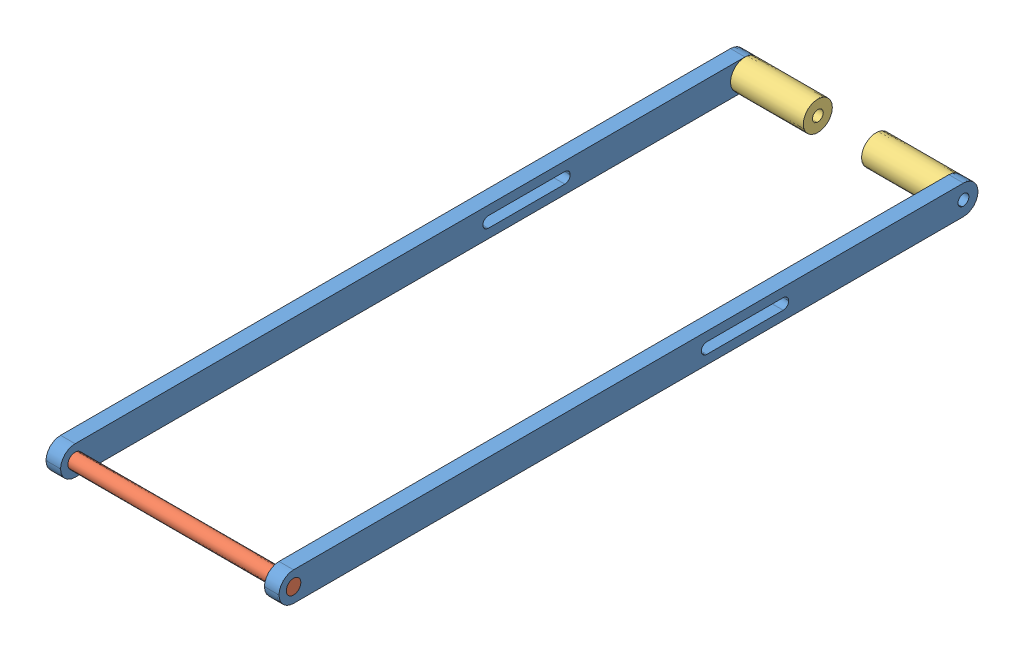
SolidWorks assembly ARBOR LEVER.SLDASM, configuration Default (file format 3100). Lengths in mm.
Overall size (203.2 25.4 609.6).
5 component instances, 3 part files, 9 mates.
Components (placement in the parent):
- LEVER-1: LEVER.SLDPRT [Default] at (-146.4047 -111.3467 152.9031) size (12.7 25.4 609.6)
- LEVER-2: LEVER.SLDPRT [Default] at (-336.9047 -111.3467 152.9031) size (12.7 25.4 609.6)
- HANDLE-1: HANDLE.SLDPRT [Default] at (-336.9047 -98.6467 140.2031) size (203.2 12.7 12.7)
- FXSPACER-1: FXSPACER.SLDPRT [Default] at (-324.2047 -98.6467 -443.9969) size (63.5 25.4 25.4)
- FXSPACER-2: FXSPACER.SLDPRT [Default] at (-209.9047 -98.6467 -443.9969) size (63.5 25.4 25.4)
Mates (geometry in assembly coordinates):
- Distance1: distance = 177.8 mm anti-aligned: plane of LEVER-1 through (-146.4047 -111.3467 -456.6969) normal (-1 0 0); plane of LEVER-2 through (-324.2047 -111.3467 -456.6969) normal (1 0 0)
- Concentric1: concentric aligned: cylinder of LEVER-1; cylinder of LEVER-2
- Concentric2: concentric aligned: cylinder of LEVER-1; cylinder of LEVER-2
- Concentric3: concentric anti-aligned: cylinder of LEVER-2; cylinder of HANDLE-1
- Coincident1: coincident aligned: plane of LEVER-1 through (-133.7047 -111.3467 -456.6969) normal (1 0 0); plane of HANDLE-1 through (-133.7047 -98.6467 140.2031) normal (1 0 0)
- Concentric4: concentric anti-aligned: cylinder of LEVER-2; cylinder of FXSPACER-1
- Coincident2: coincident anti-aligned: plane of LEVER-2; plane of FXSPACER-1
- Concentric5: concentric anti-aligned: cylinder of LEVER-1; cylinder of FXSPACER-2
- Coincident3: coincident anti-aligned: plane of LEVER-1; plane of FXSPACER-2
